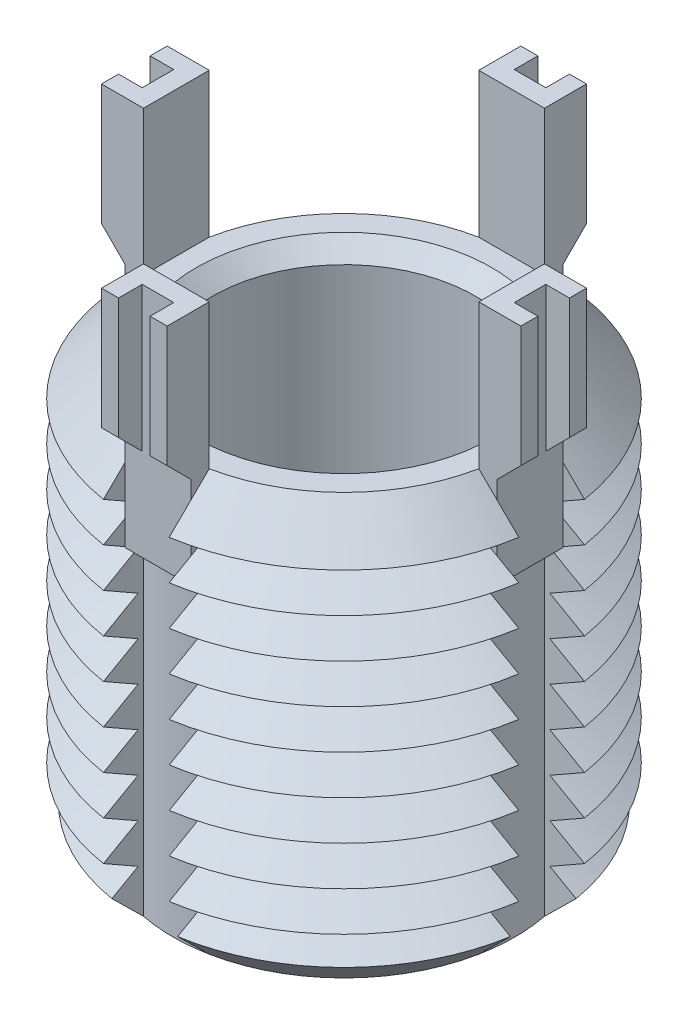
from build123d import *

# Parameters (mm, degrees)
SKETCH1_R               = 8
BOSS_EXTRUDE1_DEPTH     = 16
CHAMFER1_SIZE           = 1.5
LPATTERN1_COUNT         = 9
LPATTERN1_PITCH         = 1.5
CUT_EXTRUDE1_REACH      = 21.596
CIRPATTERN1_COUNT       = 4
BOSS_EXTRUDE3_DEPTH     = 1.25
CIRPATTERN2_COUNT       = 4
CUT_EXTRUDE3_DEPTH      = 25.281032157
CUT_EXTRUDE3_DEPTH_BACK = 25.281032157
SKETCH6_W               = 0.9
SKETCH6_H               = 1.2
SKETCH6_W_2             = 1.2
SKETCH6_H_2             = 0.9
SKETCH7_R               = 5
CUT_EXTRUDE4_DEPTH      = 16
CHAMFER2_SIZE           = 0.625


with BuildPart() as part:
    # Sketch1 → Boss-Extrude1 (new body)
    with BuildSketch(Plane(origin=(0, 0, 0), x_dir=(1, 0, 0), z_dir=(0, 1, 0))):
        with Locations(Location((0, 0, 0), (0, 0, 270))):
            Circle(SKETCH1_R)
    extrude(amount=-BOSS_EXTRUDE1_DEPTH)

    # Chamfer1
    chamfer1_edges = [part.edges().sort_by_distance(p)[0] for p in [
        (0, 0, -8),
        (0, -16, -8),
    ]]
    chamfer(chamfer1_edges, length=CHAMFER1_SIZE)

    # Sketch3 → Cut-Revolve1 (revolve, cut)
    with BuildSketch(Plane(origin=(0, 0, 0), x_dir=(0, 0, -1), z_dir=(1, 0, 0))):
        Polygon((-8, -1.5), (-6.700961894, -2.25), (-8, -3), align=None)
    cut_revolve1 = revolve(axis=Axis((0, 0.885892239, 0), (0, -1, 0)), mode=Mode.SUBTRACT)

    # LPattern1: Cut-Revolve1 ×9
    with Locations(*[(0, -i * LPATTERN1_PITCH, 0) for i in range(1, LPATTERN1_COUNT)]):
        add(cut_revolve1, mode=Mode.SUBTRACT)

    # Cut-Extrude1: up to this cone (the profile starts inside it)
    cut_extrude1_end = Plane(origin=(0, 0, 0), z_dir=(0, 1, 0)).offset(-22.499999) * Cone(1e-06, 67.096, 67.095999, align=(Align.CENTER, Align.CENTER, Align.MIN), mode=Mode.PRIVATE)
    # Sketch4 → Cut-Extrude1 (cut, up to the surface)
    with BuildSketch(Plane(origin=(0, 0, 0), x_dir=(1, 0, 0), z_dir=(0, 1, 0)), mode=Mode.PRIVATE) as cut_extrude1_sk1:
        with BuildLine():
            Line((-6.378675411, 1.25), (-7.901740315, 1.25))
            ThreePointArc((-7.901740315, 1.25), (-8, 0), (-7.901740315, -1.25))
            Line((-7.901740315, -1.25), (-6.378675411, -1.25))
            ThreePointArc((-6.378675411, -1.25), (-6.5, 0), (-6.378675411, 1.25))
        make_face()
    cut_extrude1_tool1 = extrude(cut_extrude1_sk1.sketch, amount=-CUT_EXTRUDE1_REACH, mode=Mode.PRIVATE) & cut_extrude1_end
    cut_extrude1 = cut_extrude1_tool1.solids().sort_by_distance((-7.213371, 0, 0))[0]
    add(cut_extrude1, mode=Mode.SUBTRACT)

    # CirPattern1: Cut-Extrude1 ×4 about axis
    cirpattern1_axis = Axis((0, 0, 0), (0, 1, 0))
    for i in range(1, CIRPATTERN1_COUNT):
        add(cut_extrude1.rotate(cirpattern1_axis, i * 360 / CIRPATTERN1_COUNT), mode=Mode.SUBTRACT)

    # Sketch5 → Boss-Extrude3 (add, symmetric)
    with BuildSketch(Plane(origin=(0, 0, 0), x_dir=(0, 0, -1), z_dir=(1, 0, 0))):
        Polygon((-6.378675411, 5.5), (-6.378675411, -3.5), (-7.078675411, -3.5), (-7.078675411, 0), (-7.978675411, 0.9), (-7.978675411, 5.5), align=None)
    boss_extrude3 = extrude(amount=BOSS_EXTRUDE3_DEPTH, both=True)

    # CirPattern2: Boss-Extrude3 ×4 about axis
    cirpattern2_axis = Axis((0, 0, 0), (0, 1, 0))
    for i in range(1, CIRPATTERN2_COUNT):
        add(boss_extrude3.rotate(cirpattern2_axis, i * 360 / CIRPATTERN2_COUNT))

    # Sketch6 → Cut-Extrude3 (cut, two sides: drawn at the far end of the back side and taken through both)
    with BuildSketch(Plane(origin=(0, 5.5, 0), x_dir=(1, 0, 0), z_dir=(0, 1, 0)).offset(-CUT_EXTRUDE3_DEPTH_BACK)):
        with Locations((-7.528675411, 0)):
            Rectangle(SKETCH6_W, SKETCH6_H)
        with Locations((0, 7.528675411)):
            Rectangle(SKETCH6_W_2, SKETCH6_H_2)
        with Locations((7.528675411, 0)):
            Rectangle(SKETCH6_W, SKETCH6_H)
        with Locations((0, -7.528675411)):
            Rectangle(SKETCH6_W_2, SKETCH6_H_2)
    extrude(amount=CUT_EXTRUDE3_DEPTH + CUT_EXTRUDE3_DEPTH_BACK, mode=Mode.SUBTRACT)

    # Sketch7 → Cut-Extrude4 (cut)
    with BuildSketch(Plane(origin=(0, 0, 0), x_dir=(1, 0, 0), z_dir=(0, 1, 0))):
        with Locations(Location((0, 0, 0), (0, 0, 270))):
            Circle(SKETCH7_R)
    extrude(amount=-CUT_EXTRUDE4_DEPTH, mode=Mode.SUBTRACT)

    # Chamfer2
    chamfer2_edges = [part.edges().sort_by_distance(p)[0] for p in [
        (0, 0, -5),
        (0, -16, -5),
    ]]
    chamfer(chamfer2_edges, length=CHAMFER2_SIZE)


solid = part.part
